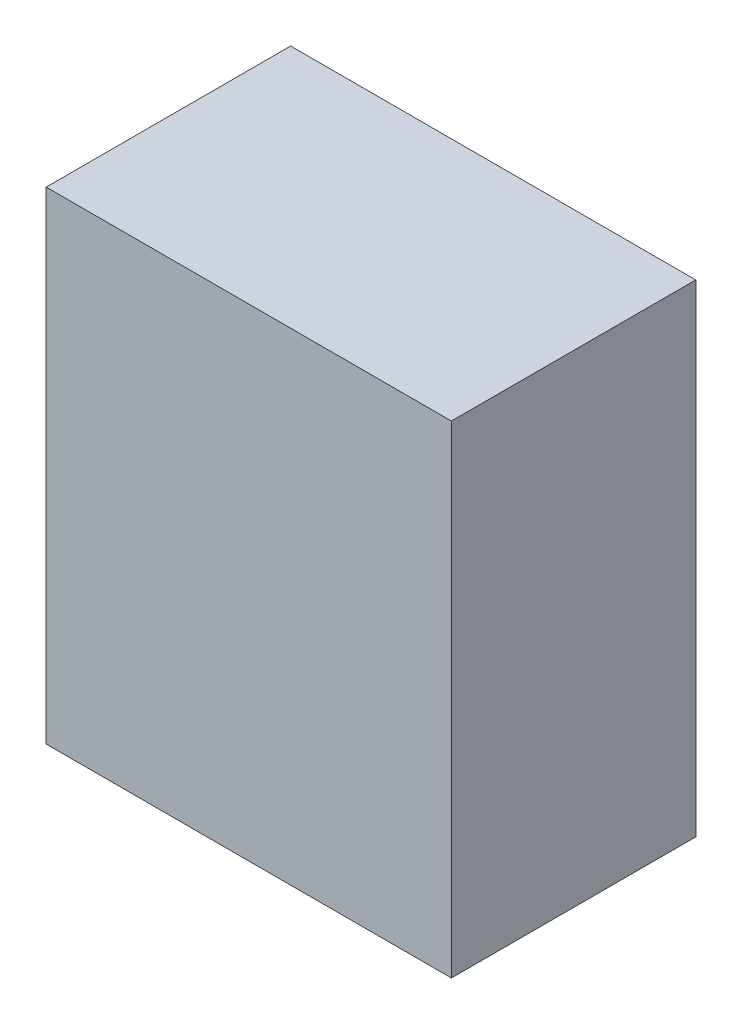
ISO-10303-21;
HEADER;
FILE_DESCRIPTION(('STEP AP214'),'2;1');
FILE_NAME('part.step','',(''),(''),'','','');
FILE_SCHEMA(('AUTOMOTIVE_DESIGN { 1 0 10303 214 1 1 1 1 }'));
ENDSEC;
DATA;
#1=APPLICATION_CONTEXT('core data for automotive mechanical design processes');
#2=APPLICATION_PROTOCOL_DEFINITION('international standard','automotive_design',2000,#1);
#3=PRODUCT_CONTEXT('',#1,'mechanical');
#4=PRODUCT('Part','Part','',(#3));
#5=PRODUCT_RELATED_PRODUCT_CATEGORY('part','',(#4));
#6=PRODUCT_DEFINITION_FORMATION('','',#4);
#7=PRODUCT_DEFINITION_CONTEXT('part definition',#1,'design');
#8=PRODUCT_DEFINITION('design','',#6,#7);
#9=PRODUCT_DEFINITION_SHAPE('','',#8);
#10=(LENGTH_UNIT() NAMED_UNIT(*) SI_UNIT(.MILLI.,.METRE.));
#11=(NAMED_UNIT(*) PLANE_ANGLE_UNIT() SI_UNIT($,.RADIAN.));
#12=(NAMED_UNIT(*) SI_UNIT($,.STERADIAN.) SOLID_ANGLE_UNIT());
#13=UNCERTAINTY_MEASURE_WITH_UNIT(LENGTH_MEASURE(1.E-05),#10,'distance_accuracy_value','');
#14=(GEOMETRIC_REPRESENTATION_CONTEXT(3) GLOBAL_UNCERTAINTY_ASSIGNED_CONTEXT((#13)) GLOBAL_UNIT_ASSIGNED_CONTEXT((#10,
#11,#12)) REPRESENTATION_CONTEXT('',''));
#15=CARTESIAN_POINT('',(0.,0.,0.));
#16=DIRECTION('',(0.,0.,1.));
#17=DIRECTION('',(1.,0.,0.));
#18=AXIS2_PLACEMENT_3D('',#15,#16,#17);
#19=CARTESIAN_POINT('',(3.15000132,3.74999758,3.80000002));
#20=DIRECTION('',(0.,0.,-1.));
#21=DIRECTION('',(-1.,0.,0.));
#22=AXIS2_PLACEMENT_3D('',#19,#20,#21);
#23=PLANE('',#22);
#24=DIRECTION('',(0.,1.,0.));
#25=VECTOR('',#24,1.);
#26=CARTESIAN_POINT('',(-3.14999878,3.75000012,3.80000002));
#27=LINE('',#26,#25);
#28=CARTESIAN_POINT('',(-3.14999878,3.75000012,3.80000002));
#29=VERTEX_POINT('',#28);
#30=CARTESIAN_POINT('',(-3.14999878,-3.74999885,3.80000002));
#31=VERTEX_POINT('',#30);
#32=EDGE_CURVE('E54',#29,#31,#27,.F.);
#33=ORIENTED_EDGE('',*,*,#32,.T.);
#34=DIRECTION('',(-0.999999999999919,-4.03174596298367E-07,0.));
#35=VECTOR('',#34,1.);
#36=CARTESIAN_POINT('',(-3.14999878,-3.75000012,3.80000002));
#37=LINE('',#36,#35);
#38=CARTESIAN_POINT('',(3.15000132,-3.74999758,3.80000002));
#39=VERTEX_POINT('',#38);
#40=EDGE_CURVE('E56',#31,#39,#37,.F.);
#41=ORIENTED_EDGE('',*,*,#40,.T.);
#42=DIRECTION('',(0.,1.,0.));
#43=VECTOR('',#42,1.);
#44=CARTESIAN_POINT('',(3.15000132,-3.74999758,3.80000002));
#45=LINE('',#44,#43);
#46=CARTESIAN_POINT('',(3.15000132,3.749998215,3.80000002));
#47=VERTEX_POINT('',#46);
#48=EDGE_CURVE('E19',#39,#47,#45,.T.);
#49=ORIENTED_EDGE('',*,*,#48,.T.);
#50=DIRECTION('',(0.999999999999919,-4.03174596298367E-07,0.));
#51=VECTOR('',#50,1.);
#52=CARTESIAN_POINT('',(3.15000132,3.74999758,3.80000002));
#53=LINE('',#52,#51);
#54=EDGE_CURVE('E79',#47,#29,#53,.F.);
#55=ORIENTED_EDGE('',*,*,#54,.T.);
#56=EDGE_LOOP('',(#33,#41,#49,#55));
#57=FACE_BOUND('',#56,.T.);
#58=ADVANCED_FACE('F16',(#57),#23,.F.);
#59=CARTESIAN_POINT('',(3.15000132,-3.74999758,0.));
#60=DIRECTION('',(-1.,0.,0.));
#61=DIRECTION('',(0.,0.,1.));
#62=AXIS2_PLACEMENT_3D('',#59,#60,#61);
#63=PLANE('',#62);
#64=DIRECTION('',(0.,0.,1.));
#65=VECTOR('',#64,1.);
#66=CARTESIAN_POINT('',(3.15000132,3.74999758,0.));
#67=LINE('',#66,#65);
#68=CARTESIAN_POINT('',(3.15000132,3.749998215,0.));
#69=VERTEX_POINT('',#68);
#70=EDGE_CURVE('E67',#69,#47,#67,.T.);
#71=ORIENTED_EDGE('',*,*,#70,.T.);
#72=ORIENTED_EDGE('',*,*,#48,.F.);
#73=DIRECTION('',(0.,0.,1.));
#74=VECTOR('',#73,1.);
#75=CARTESIAN_POINT('',(3.15000132,-3.74999758,0.));
#76=LINE('',#75,#74);
#77=CARTESIAN_POINT('',(3.15000132,-3.74999758,0.));
#78=VERTEX_POINT('',#77);
#79=EDGE_CURVE('E62',#39,#78,#76,.F.);
#80=ORIENTED_EDGE('',*,*,#79,.T.);
#81=DIRECTION('',(0.,1.,0.));
#82=VECTOR('',#81,1.);
#83=CARTESIAN_POINT('',(3.15000132,3.74999758,0.));
#84=LINE('',#83,#82);
#85=EDGE_CURVE('E82',#69,#78,#84,.F.);
#86=ORIENTED_EDGE('',*,*,#85,.F.);
#87=EDGE_LOOP('',(#71,#72,#80,#86));
#88=FACE_BOUND('',#87,.T.);
#89=ADVANCED_FACE('F64',(#88),#63,.F.);
#90=CARTESIAN_POINT('',(-3.14999878,-3.75000012,0.));
#91=DIRECTION('',(-4.03174596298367E-07,0.999999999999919,0.));
#92=DIRECTION('',(-0.999999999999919,-4.03174596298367E-07,0.));
#93=AXIS2_PLACEMENT_3D('',#90,#91,#92);
#94=PLANE('',#93);
#95=ORIENTED_EDGE('',*,*,#79,.F.);
#96=ORIENTED_EDGE('',*,*,#40,.F.);
#97=DIRECTION('',(0.,0.,-1.));
#98=VECTOR('',#97,1.);
#99=CARTESIAN_POINT('',(-3.14999878,-3.75000012,0.));
#100=LINE('',#99,#98);
#101=CARTESIAN_POINT('',(-3.14999878,-3.749999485,0.));
#102=VERTEX_POINT('',#101);
#103=EDGE_CURVE('E74',#31,#102,#100,.T.);
#104=ORIENTED_EDGE('',*,*,#103,.T.);
#105=DIRECTION('',(-1.,0.,0.));
#106=VECTOR('',#105,1.);
#107=CARTESIAN_POINT('',(3.15000132,-3.74999758,0.));
#108=LINE('',#107,#106);
#109=EDGE_CURVE('E71',#78,#102,#108,.T.);
#110=ORIENTED_EDGE('',*,*,#109,.F.);
#111=EDGE_LOOP('',(#95,#96,#104,#110));
#112=FACE_BOUND('',#111,.T.);
#113=ADVANCED_FACE('F69',(#112),#94,.F.);
#114=CARTESIAN_POINT('',(-3.14999878,3.75000012,0.));
#115=DIRECTION('',(1.,0.,0.));
#116=DIRECTION('',(0.,0.,-1.));
#117=AXIS2_PLACEMENT_3D('',#114,#115,#116);
#118=PLANE('',#117);
#119=ORIENTED_EDGE('',*,*,#103,.F.);
#120=ORIENTED_EDGE('',*,*,#32,.F.);
#121=DIRECTION('',(0.,0.,1.));
#122=VECTOR('',#121,1.);
#123=CARTESIAN_POINT('',(-3.14999878,3.75000012,0.));
#124=LINE('',#123,#122);
#125=CARTESIAN_POINT('',(-3.14999878,3.75000012,0.));
#126=VERTEX_POINT('',#125);
#127=EDGE_CURVE('E34',#29,#126,#124,.F.);
#128=ORIENTED_EDGE('',*,*,#127,.T.);
#129=DIRECTION('',(0.,1.,0.));
#130=VECTOR('',#129,1.);
#131=CARTESIAN_POINT('',(-3.14999878,3.74999758,0.));
#132=LINE('',#131,#130);
#133=EDGE_CURVE('E25',#102,#126,#132,.T.);
#134=ORIENTED_EDGE('',*,*,#133,.F.);
#135=EDGE_LOOP('',(#119,#120,#128,#134));
#136=FACE_BOUND('',#135,.T.);
#137=ADVANCED_FACE('F88',(#136),#118,.F.);
#138=CARTESIAN_POINT('',(3.15000132,3.74999758,0.));
#139=DIRECTION('',(-4.03174596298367E-07,-0.999999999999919,0.));
#140=DIRECTION('',(0.999999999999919,-4.03174596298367E-07,0.));
#141=AXIS2_PLACEMENT_3D('',#138,#139,#140);
#142=PLANE('',#141);
#143=ORIENTED_EDGE('',*,*,#127,.F.);
#144=ORIENTED_EDGE('',*,*,#54,.F.);
#145=ORIENTED_EDGE('',*,*,#70,.F.);
#146=DIRECTION('',(-1.,0.,0.));
#147=VECTOR('',#146,1.);
#148=CARTESIAN_POINT('',(3.15000132,3.75000012,0.));
#149=LINE('',#148,#147);
#150=EDGE_CURVE('E11',#126,#69,#149,.F.);
#151=ORIENTED_EDGE('',*,*,#150,.F.);
#152=EDGE_LOOP('',(#143,#144,#145,#151));
#153=FACE_BOUND('',#152,.T.);
#154=ADVANCED_FACE('F90',(#153),#142,.F.);
#155=CARTESIAN_POINT('',(3.15000132,3.74999758,0.));
#156=DIRECTION('',(0.,0.,-1.));
#157=DIRECTION('',(-1.,0.,0.));
#158=AXIS2_PLACEMENT_3D('',#155,#156,#157);
#159=PLANE('',#158);
#160=ORIENTED_EDGE('',*,*,#133,.T.);
#161=ORIENTED_EDGE('',*,*,#150,.T.);
#162=ORIENTED_EDGE('',*,*,#85,.T.);
#163=ORIENTED_EDGE('',*,*,#109,.T.);
#164=EDGE_LOOP('',(#160,#161,#162,#163));
#165=FACE_BOUND('',#164,.T.);
#166=ADVANCED_FACE('F87',(#165),#159,.T.);
#167=CLOSED_SHELL('',(#58,#89,#113,#137,#154,#166));
#168=MANIFOLD_SOLID_BREP('B1',#167);
#169=ADVANCED_BREP_SHAPE_REPRESENTATION('',(#18,#168),#14);
#170=SHAPE_DEFINITION_REPRESENTATION(#9,#169);
ENDSEC;
END-ISO-10303-21;
